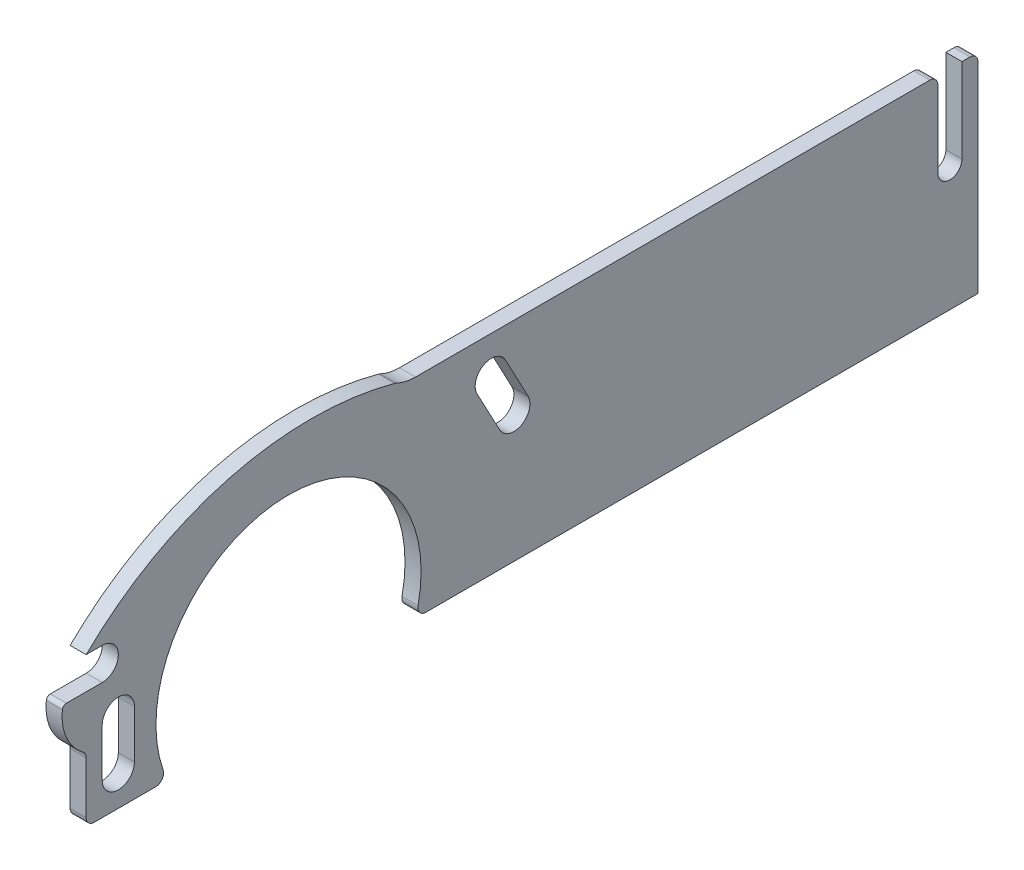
ISO-10303-21;
HEADER;
FILE_DESCRIPTION(('STEP AP214'),'2;1');
FILE_NAME('part.step','',(''),(''),'','','');
FILE_SCHEMA(('AUTOMOTIVE_DESIGN { 1 0 10303 214 1 1 1 1 }'));
ENDSEC;
DATA;
#1=APPLICATION_CONTEXT('core data for automotive mechanical design processes');
#2=APPLICATION_PROTOCOL_DEFINITION('international standard','automotive_design',2000,#1);
#3=PRODUCT_CONTEXT('',#1,'mechanical');
#4=PRODUCT('Part','Part','',(#3));
#5=PRODUCT_RELATED_PRODUCT_CATEGORY('part','',(#4));
#6=PRODUCT_DEFINITION_FORMATION('','',#4);
#7=PRODUCT_DEFINITION_CONTEXT('part definition',#1,'design');
#8=PRODUCT_DEFINITION('design','',#6,#7);
#9=PRODUCT_DEFINITION_SHAPE('','',#8);
#10=(LENGTH_UNIT() NAMED_UNIT(*) SI_UNIT(.MILLI.,.METRE.));
#11=(NAMED_UNIT(*) PLANE_ANGLE_UNIT() SI_UNIT($,.RADIAN.));
#12=(NAMED_UNIT(*) SI_UNIT($,.STERADIAN.) SOLID_ANGLE_UNIT());
#13=UNCERTAINTY_MEASURE_WITH_UNIT(LENGTH_MEASURE(1.E-05),#10,'distance_accuracy_value','');
#14=(GEOMETRIC_REPRESENTATION_CONTEXT(3) GLOBAL_UNCERTAINTY_ASSIGNED_CONTEXT((#13)) GLOBAL_UNIT_ASSIGNED_CONTEXT((#10,
#11,#12)) REPRESENTATION_CONTEXT('',''));
#15=CARTESIAN_POINT('',(0.,0.,0.));
#16=DIRECTION('',(0.,0.,1.));
#17=DIRECTION('',(1.,0.,0.));
#18=AXIS2_PLACEMENT_3D('',#15,#16,#17);
#19=CARTESIAN_POINT('',(2.,0.999999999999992,68.7115878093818));
#20=DIRECTION('',(-1.,0.,0.));
#21=DIRECTION('',(0.,0.,1.));
#22=AXIS2_PLACEMENT_3D('',#19,#20,#21);
#23=PLANE('',#22);
#24=CARTESIAN_POINT('',(2.,7.99999999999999,107.));
#25=DIRECTION('',(1.,0.,0.));
#26=DIRECTION('',(0.,0.,-1.));
#27=AXIS2_PLACEMENT_3D('',#24,#25,#26);
#28=CIRCLE('',#27,2.);
#29=CARTESIAN_POINT('',(2.,7.99999999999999,105.));
#30=VERTEX_POINT('',#29);
#31=CARTESIAN_POINT('',(2.,7.99999999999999,109.));
#32=VERTEX_POINT('',#31);
#33=EDGE_CURVE('E277',#30,#32,#28,.T.);
#34=ORIENTED_EDGE('',*,*,#33,.F.);
#35=DIRECTION('',(0.,1.,0.));
#36=VECTOR('',#35,1.);
#37=CARTESIAN_POINT('',(2.,7.99999999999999,105.));
#38=LINE('',#37,#36);
#39=CARTESIAN_POINT('',(2.,1.99999999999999,105.));
#40=VERTEX_POINT('',#39);
#41=EDGE_CURVE('E285',#40,#30,#38,.T.);
#42=ORIENTED_EDGE('',*,*,#41,.F.);
#43=CARTESIAN_POINT('',(2.,1.99999999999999,107.));
#44=DIRECTION('',(1.,0.,0.));
#45=DIRECTION('',(0.,0.,-1.));
#46=AXIS2_PLACEMENT_3D('',#43,#44,#45);
#47=CIRCLE('',#46,2.);
#48=CARTESIAN_POINT('',(2.,1.99999999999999,109.));
#49=VERTEX_POINT('',#48);
#50=EDGE_CURVE('E282',#49,#40,#47,.T.);
#51=ORIENTED_EDGE('',*,*,#50,.F.);
#52=DIRECTION('',(0.,-1.,0.));
#53=VECTOR('',#52,1.);
#54=CARTESIAN_POINT('',(2.,7.99999999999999,109.));
#55=LINE('',#54,#53);
#56=EDGE_CURVE('E279',#32,#49,#55,.T.);
#57=ORIENTED_EDGE('',*,*,#56,.F.);
#58=EDGE_LOOP('',(#34,#42,#51,#57));
#59=FACE_BOUND('',#58,.T.);
#60=DIRECTION('',(0.,0.,-1.));
#61=VECTOR('',#60,1.);
#62=CARTESIAN_POINT('',(2.,0.,0.));
#63=LINE('',#62,#61);
#64=CARTESIAN_POINT('',(2.,0.,68.7115878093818));
#65=VERTEX_POINT('',#64);
#66=CARTESIAN_POINT('',(2.,0.,0.));
#67=VERTEX_POINT('',#66);
#68=EDGE_CURVE('E308',#65,#67,#63,.T.);
#69=ORIENTED_EDGE('',*,*,#68,.T.);
#70=DIRECTION('',(0.,1.,0.));
#71=VECTOR('',#70,1.);
#72=CARTESIAN_POINT('',(2.,0.,0.));
#73=LINE('',#72,#71);
#74=CARTESIAN_POINT('',(2.,25.,0.));
#75=VERTEX_POINT('',#74);
#76=EDGE_CURVE('E311',#67,#75,#73,.T.);
#77=ORIENTED_EDGE('',*,*,#76,.T.);
#78=CARTESIAN_POINT('',(2.,25.,1.));
#79=DIRECTION('',(1.,0.,0.));
#80=DIRECTION('',(0.,0.,-1.));
#81=AXIS2_PLACEMENT_3D('',#78,#79,#80);
#82=CIRCLE('',#81,1.);
#83=CARTESIAN_POINT('',(2.,26.,1.00000000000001));
#84=VERTEX_POINT('',#83);
#85=EDGE_CURVE('E314',#75,#84,#82,.T.);
#86=ORIENTED_EDGE('',*,*,#85,.T.);
#87=DIRECTION('',(0.,0.,1.));
#88=VECTOR('',#87,1.);
#89=CARTESIAN_POINT('',(2.,26.,1.00000000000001));
#90=LINE('',#89,#88);
#91=CARTESIAN_POINT('',(2.,26.,2.));
#92=VERTEX_POINT('',#91);
#93=EDGE_CURVE('E316',#84,#92,#90,.T.);
#94=ORIENTED_EDGE('',*,*,#93,.T.);
#95=DIRECTION('',(0.,-1.,0.));
#96=VECTOR('',#95,1.);
#97=CARTESIAN_POINT('',(2.,26.,2.));
#98=LINE('',#97,#96);
#99=CARTESIAN_POINT('',(2.,15.5,2.));
#100=VERTEX_POINT('',#99);
#101=EDGE_CURVE('E318',#92,#100,#98,.T.);
#102=ORIENTED_EDGE('',*,*,#101,.T.);
#103=CARTESIAN_POINT('',(2.,15.5,3.5));
#104=DIRECTION('',(-1.,0.,0.));
#105=DIRECTION('',(0.,0.,-1.));
#106=AXIS2_PLACEMENT_3D('',#103,#104,#105);
#107=CIRCLE('',#106,1.5);
#108=CARTESIAN_POINT('',(2.,15.5,5.));
#109=VERTEX_POINT('',#108);
#110=EDGE_CURVE('E320',#100,#109,#107,.T.);
#111=ORIENTED_EDGE('',*,*,#110,.T.);
#112=DIRECTION('',(0.,1.,0.));
#113=VECTOR('',#112,1.);
#114=CARTESIAN_POINT('',(2.,25.,5.));
#115=LINE('',#114,#113);
#116=CARTESIAN_POINT('',(2.,25.,5.));
#117=VERTEX_POINT('',#116);
#118=EDGE_CURVE('E322',#109,#117,#115,.T.);
#119=ORIENTED_EDGE('',*,*,#118,.T.);
#120=CARTESIAN_POINT('',(2.,25.,6.));
#121=DIRECTION('',(1.,0.,0.));
#122=DIRECTION('',(0.,0.,-1.));
#123=AXIS2_PLACEMENT_3D('',#120,#121,#122);
#124=CIRCLE('',#123,1.);
#125=CARTESIAN_POINT('',(2.,26.,6.));
#126=VERTEX_POINT('',#125);
#127=EDGE_CURVE('E324',#117,#126,#124,.T.);
#128=ORIENTED_EDGE('',*,*,#127,.T.);
#129=DIRECTION('',(0.,0.,1.));
#130=VECTOR('',#129,1.);
#131=CARTESIAN_POINT('',(2.,26.,6.));
#132=LINE('',#131,#130);
#133=CARTESIAN_POINT('',(2.,26.,70.));
#134=VERTEX_POINT('',#133);
#135=EDGE_CURVE('E326',#126,#134,#132,.T.);
#136=ORIENTED_EDGE('',*,*,#135,.T.);
#137=CARTESIAN_POINT('',(2.,31.5939226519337,70.));
#138=DIRECTION('',(-1.,0.,0.));
#139=DIRECTION('',(0.,0.,1.));
#140=AXIS2_PLACEMENT_3D('',#137,#138,#139);
#141=CIRCLE('',#140,5.59392265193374);
#142=CARTESIAN_POINT('',(2.,26.5573087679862,72.4340277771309));
#143=VERTEX_POINT('',#142);
#144=EDGE_CURVE('E328',#134,#143,#141,.T.);
#145=ORIENTED_EDGE('',*,*,#144,.T.);
#146=CARTESIAN_POINT('',(2.,25.6569363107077,72.8691478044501));
#147=DIRECTION('',(1.,0.,0.));
#148=DIRECTION('',(0.,0.,-1.));
#149=AXIS2_PLACEMENT_3D('',#146,#147,#148);
#150=CIRCLE('',#149,1.);
#151=CARTESIAN_POINT('',(2.,26.6224823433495,72.6089154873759));
#152=VERTEX_POINT('',#151);
#153=EDGE_CURVE('E330',#143,#152,#150,.T.);
#154=ORIENTED_EDGE('',*,*,#153,.T.);
#155=CARTESIAN_POINT('',(2.,-11.9813943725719,83.0133663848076));
#156=DIRECTION('',(1.,0.,0.));
#157=DIRECTION('',(0.,0.,-1.));
#158=AXIS2_PLACEMENT_3D('',#155,#156,#157);
#159=CIRCLE('',#158,39.9813943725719);
#160=CARTESIAN_POINT('',(2.,16.5713679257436,111.));
#161=VERTEX_POINT('',#160);
#162=EDGE_CURVE('E332',#152,#161,#159,.T.);
#163=ORIENTED_EDGE('',*,*,#162,.T.);
#164=DIRECTION('',(0.,0.,-1.));
#165=VECTOR('',#164,1.);
#166=CARTESIAN_POINT('',(2.,16.5713679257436,111.));
#167=LINE('',#166,#165);
#168=CARTESIAN_POINT('',(2.,16.5713679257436,109.));
#169=VERTEX_POINT('',#168);
#170=EDGE_CURVE('E334',#161,#169,#167,.T.);
#171=ORIENTED_EDGE('',*,*,#170,.T.);
#172=CARTESIAN_POINT('',(2.,14.5713679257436,109.));
#173=DIRECTION('',(-1.,0.,0.));
#174=DIRECTION('',(0.,0.,-1.));
#175=AXIS2_PLACEMENT_3D('',#172,#173,#174);
#176=CIRCLE('',#175,2.);
#177=CARTESIAN_POINT('',(2.,12.5713679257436,109.));
#178=VERTEX_POINT('',#177);
#179=EDGE_CURVE('E336',#169,#178,#176,.T.);
#180=ORIENTED_EDGE('',*,*,#179,.T.);
#181=DIRECTION('',(0.,0.,1.));
#182=VECTOR('',#181,1.);
#183=CARTESIAN_POINT('',(2.,12.5713679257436,113.466213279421));
#184=LINE('',#183,#182);
#185=CARTESIAN_POINT('',(2.,12.5713679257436,113.466213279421));
#186=VERTEX_POINT('',#185);
#187=EDGE_CURVE('E338',#178,#186,#184,.T.);
#188=ORIENTED_EDGE('',*,*,#187,.T.);
#189=CARTESIAN_POINT('',(2.,12.0713679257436,113.466213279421));
#190=DIRECTION('',(1.,0.,0.));
#191=DIRECTION('',(0.,0.,1.));
#192=AXIS2_PLACEMENT_3D('',#189,#190,#191);
#193=CIRCLE('',#192,0.500000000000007);
#194=CARTESIAN_POINT('',(2.,12.1246622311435,113.963364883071));
#195=VERTEX_POINT('',#194);
#196=EDGE_CURVE('E340',#186,#195,#193,.T.);
#197=ORIENTED_EDGE('',*,*,#196,.T.);
#198=CARTESIAN_POINT('',(2.,11.4392087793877,107.569167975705));
#199=DIRECTION('',(1.,0.,0.));
#200=DIRECTION('',(0.,0.,-1.));
#201=AXIS2_PLACEMENT_3D('',#198,#199,#200);
#202=CIRCLE('',#201,6.43083202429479);
#203=CARTESIAN_POINT('',(2.,6.276671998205,111.403723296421));
#204=VERTEX_POINT('',#203);
#205=EDGE_CURVE('E342',#195,#204,#202,.T.);
#206=ORIENTED_EDGE('',*,*,#205,.T.);
#207=CARTESIAN_POINT('',(2.,5.47389301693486,112.));
#208=DIRECTION('',(-1.,0.,0.));
#209=DIRECTION('',(0.,0.,1.));
#210=AXIS2_PLACEMENT_3D('',#207,#208,#209);
#211=CIRCLE('',#210,0.999999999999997);
#212=CARTESIAN_POINT('',(2.,5.47389301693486,111.));
#213=VERTEX_POINT('',#212);
#214=EDGE_CURVE('E344',#204,#213,#211,.T.);
#215=ORIENTED_EDGE('',*,*,#214,.T.);
#216=DIRECTION('',(0.,-1.,0.));
#217=VECTOR('',#216,1.);
#218=CARTESIAN_POINT('',(2.,5.47389301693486,111.));
#219=LINE('',#218,#217);
#220=CARTESIAN_POINT('',(2.,-1.00000000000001,111.));
#221=VERTEX_POINT('',#220);
#222=EDGE_CURVE('E346',#213,#221,#219,.T.);
#223=ORIENTED_EDGE('',*,*,#222,.T.);
#224=CARTESIAN_POINT('',(2.,-1.00000000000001,110.));
#225=DIRECTION('',(1.,0.,0.));
#226=DIRECTION('',(0.,0.,-1.));
#227=AXIS2_PLACEMENT_3D('',#224,#225,#226);
#228=CIRCLE('',#227,1.);
#229=CARTESIAN_POINT('',(2.,-2.00000000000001,110.));
#230=VERTEX_POINT('',#229);
#231=EDGE_CURVE('E348',#221,#230,#228,.T.);
#232=ORIENTED_EDGE('',*,*,#231,.T.);
#233=DIRECTION('',(0.,0.,-1.));
#234=VECTOR('',#233,1.);
#235=CARTESIAN_POINT('',(2.,-2.00000000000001,110.));
#236=LINE('',#235,#234);
#237=CARTESIAN_POINT('',(2.,-2.00000000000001,102.358378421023));
#238=VERTEX_POINT('',#237);
#239=EDGE_CURVE('E350',#230,#238,#236,.T.);
#240=ORIENTED_EDGE('',*,*,#239,.T.);
#241=CARTESIAN_POINT('',(2.,-1.00000000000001,102.358378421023));
#242=DIRECTION('',(1.,0.,0.));
#243=DIRECTION('',(0.,0.,-1.));
#244=AXIS2_PLACEMENT_3D('',#241,#242,#243);
#245=CIRCLE('',#244,1.00000000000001);
#246=CARTESIAN_POINT('',(2.,-0.673950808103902,101.413025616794));
#247=VERTEX_POINT('',#246);
#248=EDGE_CURVE('E352',#238,#247,#245,.T.);
#249=ORIENTED_EDGE('',*,*,#248,.T.);
#250=CARTESIAN_POINT('',(2.,4.70586085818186,85.814704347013));
#251=DIRECTION('',(-1.,0.,0.));
#252=DIRECTION('',(0.,0.,-1.));
#253=AXIS2_PLACEMENT_3D('',#250,#251,#252);
#254=CIRCLE('',#253,16.5);
#255=CARTESIAN_POINT('',(2.,1.21176347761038,69.6889087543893));
#256=VERTEX_POINT('',#255);
#257=EDGE_CURVE('E354',#247,#256,#254,.T.);
#258=ORIENTED_EDGE('',*,*,#257,.T.);
#259=CARTESIAN_POINT('',(2.,0.999999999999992,68.7115878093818));
#260=DIRECTION('',(1.,0.,0.));
#261=DIRECTION('',(0.,0.,1.));
#262=AXIS2_PLACEMENT_3D('',#259,#260,#261);
#263=CIRCLE('',#262,0.99999999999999);
#264=EDGE_CURVE('E356',#256,#65,#263,.T.);
#265=ORIENTED_EDGE('',*,*,#264,.T.);
#266=EDGE_LOOP('',(#69,#77,#86,#94,#102,#111,#119,#128,#136,#145,#154,#163,#171,#180,#188,#197,
#206,#215,#223,#232,#240,#249,#258,#265));
#267=FACE_BOUND('',#266,.T.);
#268=CARTESIAN_POINT('',(2.,21.2976855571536,60.5827245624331));
#269=DIRECTION('',(1.,0.,0.));
#270=DIRECTION('',(0.,0.,-1.));
#271=AXIS2_PLACEMENT_3D('',#268,#269,#270);
#272=CIRCLE('',#271,2.);
#273=CARTESIAN_POINT('',(2.,22.2366286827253,58.8168293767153));
#274=VERTEX_POINT('',#273);
#275=CARTESIAN_POINT('',(2.,20.3587424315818,62.348619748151));
#276=VERTEX_POINT('',#275);
#277=EDGE_CURVE('E241',#274,#276,#272,.T.);
#278=ORIENTED_EDGE('',*,*,#277,.F.);
#279=DIRECTION('',(0.,0.882947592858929,0.469471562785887));
#280=VECTOR('',#279,1.);
#281=CARTESIAN_POINT('',(2.,22.2366286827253,58.8168293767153));
#282=LINE('',#281,#280);
#283=CARTESIAN_POINT('',(2.,16.9389431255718,56.));
#284=VERTEX_POINT('',#283);
#285=EDGE_CURVE('E263',#284,#274,#282,.T.);
#286=ORIENTED_EDGE('',*,*,#285,.F.);
#287=CARTESIAN_POINT('',(2.,16.,57.7658951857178));
#288=DIRECTION('',(1.,0.,0.));
#289=DIRECTION('',(0.,0.,-1.));
#290=AXIS2_PLACEMENT_3D('',#287,#288,#289);
#291=CIRCLE('',#290,2.00000000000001);
#292=CARTESIAN_POINT('',(2.,15.0610568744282,59.5317903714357));
#293=VERTEX_POINT('',#292);
#294=EDGE_CURVE('E261',#293,#284,#291,.T.);
#295=ORIENTED_EDGE('',*,*,#294,.F.);
#296=DIRECTION('',(0.,-0.882947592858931,-0.469471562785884));
#297=VECTOR('',#296,1.);
#298=CARTESIAN_POINT('',(2.,20.3587424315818,62.348619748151));
#299=LINE('',#298,#297);
#300=EDGE_CURVE('E249',#276,#293,#299,.T.);
#301=ORIENTED_EDGE('',*,*,#300,.F.);
#302=EDGE_LOOP('',(#278,#286,#295,#301));
#303=FACE_BOUND('',#302,.T.);
#304=ADVANCED_FACE('F32',(#59,#267,#303),#23,.F.);
#305=CARTESIAN_POINT('',(0.,0.999999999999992,68.7115878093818));
#306=DIRECTION('',(-1.,0.,0.));
#307=DIRECTION('',(0.,0.,1.));
#308=AXIS2_PLACEMENT_3D('',#305,#306,#307);
#309=PLANE('',#308);
#310=DIRECTION('',(0.,1.,0.));
#311=VECTOR('',#310,1.);
#312=CARTESIAN_POINT('',(0.,7.99999999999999,105.));
#313=LINE('',#312,#311);
#314=CARTESIAN_POINT('',(0.,1.99999999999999,105.));
#315=VERTEX_POINT('',#314);
#316=CARTESIAN_POINT('',(0.,7.99999999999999,105.));
#317=VERTEX_POINT('',#316);
#318=EDGE_CURVE('E280',#315,#317,#313,.T.);
#319=ORIENTED_EDGE('',*,*,#318,.T.);
#320=CARTESIAN_POINT('',(0.,7.99999999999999,107.));
#321=DIRECTION('',(1.,0.,0.));
#322=DIRECTION('',(0.,0.,-1.));
#323=AXIS2_PLACEMENT_3D('',#320,#321,#322);
#324=CIRCLE('',#323,2.);
#325=CARTESIAN_POINT('',(0.,7.99999999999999,109.));
#326=VERTEX_POINT('',#325);
#327=EDGE_CURVE('E257',#317,#326,#324,.T.);
#328=ORIENTED_EDGE('',*,*,#327,.T.);
#329=DIRECTION('',(0.,-1.,0.));
#330=VECTOR('',#329,1.);
#331=CARTESIAN_POINT('',(0.,7.99999999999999,109.));
#332=LINE('',#331,#330);
#333=CARTESIAN_POINT('',(0.,1.99999999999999,109.));
#334=VERTEX_POINT('',#333);
#335=EDGE_CURVE('E290',#326,#334,#332,.T.);
#336=ORIENTED_EDGE('',*,*,#335,.T.);
#337=CARTESIAN_POINT('',(0.,1.99999999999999,107.));
#338=DIRECTION('',(1.,0.,0.));
#339=DIRECTION('',(0.,0.,-1.));
#340=AXIS2_PLACEMENT_3D('',#337,#338,#339);
#341=CIRCLE('',#340,2.);
#342=EDGE_CURVE('E293',#334,#315,#341,.T.);
#343=ORIENTED_EDGE('',*,*,#342,.T.);
#344=EDGE_LOOP('',(#319,#328,#336,#343));
#345=FACE_BOUND('',#344,.T.);
#346=DIRECTION('',(0.,0.,-1.));
#347=VECTOR('',#346,1.);
#348=CARTESIAN_POINT('',(0.,0.,0.));
#349=LINE('',#348,#347);
#350=CARTESIAN_POINT('',(0.,0.,68.7115878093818));
#351=VERTEX_POINT('',#350);
#352=CARTESIAN_POINT('',(0.,0.,0.));
#353=VERTEX_POINT('',#352);
#354=EDGE_CURVE('E307',#351,#353,#349,.T.);
#355=ORIENTED_EDGE('',*,*,#354,.F.);
#356=CARTESIAN_POINT('',(0.,0.999999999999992,68.7115878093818));
#357=DIRECTION('',(1.,0.,0.));
#358=DIRECTION('',(0.,0.,1.));
#359=AXIS2_PLACEMENT_3D('',#356,#357,#358);
#360=CIRCLE('',#359,0.99999999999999);
#361=CARTESIAN_POINT('',(0.,1.21176347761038,69.6889087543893));
#362=VERTEX_POINT('',#361);
#363=EDGE_CURVE('E312',#362,#351,#360,.T.);
#364=ORIENTED_EDGE('',*,*,#363,.F.);
#365=CARTESIAN_POINT('',(0.,4.70586085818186,85.814704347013));
#366=DIRECTION('',(-1.,0.,0.));
#367=DIRECTION('',(0.,0.,-1.));
#368=AXIS2_PLACEMENT_3D('',#365,#366,#367);
#369=CIRCLE('',#368,16.5);
#370=CARTESIAN_POINT('',(0.,-0.673950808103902,101.413025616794));
#371=VERTEX_POINT('',#370);
#372=EDGE_CURVE('E403',#371,#362,#369,.T.);
#373=ORIENTED_EDGE('',*,*,#372,.F.);
#374=CARTESIAN_POINT('',(0.,-1.00000000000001,102.358378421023));
#375=DIRECTION('',(1.,0.,0.));
#376=DIRECTION('',(0.,0.,-1.));
#377=AXIS2_PLACEMENT_3D('',#374,#375,#376);
#378=CIRCLE('',#377,1.00000000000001);
#379=CARTESIAN_POINT('',(0.,-2.00000000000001,102.358378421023));
#380=VERTEX_POINT('',#379);
#381=EDGE_CURVE('E401',#380,#371,#378,.T.);
#382=ORIENTED_EDGE('',*,*,#381,.F.);
#383=DIRECTION('',(0.,0.,-1.));
#384=VECTOR('',#383,1.);
#385=CARTESIAN_POINT('',(0.,-2.00000000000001,110.));
#386=LINE('',#385,#384);
#387=CARTESIAN_POINT('',(0.,-2.00000000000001,110.));
#388=VERTEX_POINT('',#387);
#389=EDGE_CURVE('E399',#388,#380,#386,.T.);
#390=ORIENTED_EDGE('',*,*,#389,.F.);
#391=CARTESIAN_POINT('',(0.,-1.00000000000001,110.));
#392=DIRECTION('',(1.,0.,0.));
#393=DIRECTION('',(0.,0.,-1.));
#394=AXIS2_PLACEMENT_3D('',#391,#392,#393);
#395=CIRCLE('',#394,1.);
#396=CARTESIAN_POINT('',(0.,-1.00000000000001,111.));
#397=VERTEX_POINT('',#396);
#398=EDGE_CURVE('E397',#397,#388,#395,.T.);
#399=ORIENTED_EDGE('',*,*,#398,.F.);
#400=DIRECTION('',(0.,-1.,0.));
#401=VECTOR('',#400,1.);
#402=CARTESIAN_POINT('',(0.,5.47389301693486,111.));
#403=LINE('',#402,#401);
#404=CARTESIAN_POINT('',(0.,5.47389301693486,111.));
#405=VERTEX_POINT('',#404);
#406=EDGE_CURVE('E395',#405,#397,#403,.T.);
#407=ORIENTED_EDGE('',*,*,#406,.F.);
#408=CARTESIAN_POINT('',(0.,5.47389301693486,112.));
#409=DIRECTION('',(-1.,0.,0.));
#410=DIRECTION('',(0.,0.,1.));
#411=AXIS2_PLACEMENT_3D('',#408,#409,#410);
#412=CIRCLE('',#411,0.999999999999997);
#413=CARTESIAN_POINT('',(0.,6.276671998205,111.403723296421));
#414=VERTEX_POINT('',#413);
#415=EDGE_CURVE('E393',#414,#405,#412,.T.);
#416=ORIENTED_EDGE('',*,*,#415,.F.);
#417=CARTESIAN_POINT('',(0.,11.4392087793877,107.569167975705));
#418=DIRECTION('',(1.,0.,0.));
#419=DIRECTION('',(0.,0.,-1.));
#420=AXIS2_PLACEMENT_3D('',#417,#418,#419);
#421=CIRCLE('',#420,6.43083202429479);
#422=CARTESIAN_POINT('',(0.,12.1246622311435,113.963364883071));
#423=VERTEX_POINT('',#422);
#424=EDGE_CURVE('E391',#423,#414,#421,.T.);
#425=ORIENTED_EDGE('',*,*,#424,.F.);
#426=CARTESIAN_POINT('',(0.,12.0713679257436,113.466213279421));
#427=DIRECTION('',(1.,0.,0.));
#428=DIRECTION('',(0.,0.,1.));
#429=AXIS2_PLACEMENT_3D('',#426,#427,#428);
#430=CIRCLE('',#429,0.500000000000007);
#431=CARTESIAN_POINT('',(0.,12.5713679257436,113.466213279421));
#432=VERTEX_POINT('',#431);
#433=EDGE_CURVE('E389',#432,#423,#430,.T.);
#434=ORIENTED_EDGE('',*,*,#433,.F.);
#435=DIRECTION('',(0.,0.,1.));
#436=VECTOR('',#435,1.);
#437=CARTESIAN_POINT('',(0.,12.5713679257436,113.466213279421));
#438=LINE('',#437,#436);
#439=CARTESIAN_POINT('',(0.,12.5713679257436,109.));
#440=VERTEX_POINT('',#439);
#441=EDGE_CURVE('E387',#440,#432,#438,.T.);
#442=ORIENTED_EDGE('',*,*,#441,.F.);
#443=CARTESIAN_POINT('',(0.,14.5713679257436,109.));
#444=DIRECTION('',(-1.,0.,0.));
#445=DIRECTION('',(0.,0.,-1.));
#446=AXIS2_PLACEMENT_3D('',#443,#444,#445);
#447=CIRCLE('',#446,2.);
#448=CARTESIAN_POINT('',(0.,16.5713679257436,109.));
#449=VERTEX_POINT('',#448);
#450=EDGE_CURVE('E385',#449,#440,#447,.T.);
#451=ORIENTED_EDGE('',*,*,#450,.F.);
#452=DIRECTION('',(0.,0.,-1.));
#453=VECTOR('',#452,1.);
#454=CARTESIAN_POINT('',(0.,16.5713679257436,111.));
#455=LINE('',#454,#453);
#456=CARTESIAN_POINT('',(0.,16.5713679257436,111.));
#457=VERTEX_POINT('',#456);
#458=EDGE_CURVE('E383',#457,#449,#455,.T.);
#459=ORIENTED_EDGE('',*,*,#458,.F.);
#460=CARTESIAN_POINT('',(0.,-11.9813943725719,83.0133663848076));
#461=DIRECTION('',(1.,0.,0.));
#462=DIRECTION('',(0.,0.,-1.));
#463=AXIS2_PLACEMENT_3D('',#460,#461,#462);
#464=CIRCLE('',#463,39.9813943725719);
#465=CARTESIAN_POINT('',(0.,26.6224823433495,72.6089154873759));
#466=VERTEX_POINT('',#465);
#467=EDGE_CURVE('E381',#466,#457,#464,.T.);
#468=ORIENTED_EDGE('',*,*,#467,.F.);
#469=CARTESIAN_POINT('',(0.,25.6569363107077,72.8691478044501));
#470=DIRECTION('',(1.,0.,0.));
#471=DIRECTION('',(0.,0.,-1.));
#472=AXIS2_PLACEMENT_3D('',#469,#470,#471);
#473=CIRCLE('',#472,1.);
#474=CARTESIAN_POINT('',(0.,26.5573087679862,72.4340277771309));
#475=VERTEX_POINT('',#474);
#476=EDGE_CURVE('E379',#475,#466,#473,.T.);
#477=ORIENTED_EDGE('',*,*,#476,.F.);
#478=CARTESIAN_POINT('',(0.,31.5939226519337,70.));
#479=DIRECTION('',(-1.,0.,0.));
#480=DIRECTION('',(0.,0.,1.));
#481=AXIS2_PLACEMENT_3D('',#478,#479,#480);
#482=CIRCLE('',#481,5.59392265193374);
#483=CARTESIAN_POINT('',(0.,26.,70.));
#484=VERTEX_POINT('',#483);
#485=EDGE_CURVE('E377',#484,#475,#482,.T.);
#486=ORIENTED_EDGE('',*,*,#485,.F.);
#487=DIRECTION('',(0.,0.,1.));
#488=VECTOR('',#487,1.);
#489=CARTESIAN_POINT('',(0.,26.,6.));
#490=LINE('',#489,#488);
#491=CARTESIAN_POINT('',(0.,26.,6.));
#492=VERTEX_POINT('',#491);
#493=EDGE_CURVE('E375',#492,#484,#490,.T.);
#494=ORIENTED_EDGE('',*,*,#493,.F.);
#495=CARTESIAN_POINT('',(0.,25.,6.));
#496=DIRECTION('',(1.,0.,0.));
#497=DIRECTION('',(0.,0.,-1.));
#498=AXIS2_PLACEMENT_3D('',#495,#496,#497);
#499=CIRCLE('',#498,1.);
#500=CARTESIAN_POINT('',(0.,25.,5.));
#501=VERTEX_POINT('',#500);
#502=EDGE_CURVE('E373',#501,#492,#499,.T.);
#503=ORIENTED_EDGE('',*,*,#502,.F.);
#504=DIRECTION('',(0.,1.,0.));
#505=VECTOR('',#504,1.);
#506=CARTESIAN_POINT('',(0.,25.,5.));
#507=LINE('',#506,#505);
#508=CARTESIAN_POINT('',(0.,15.5,5.));
#509=VERTEX_POINT('',#508);
#510=EDGE_CURVE('E371',#509,#501,#507,.T.);
#511=ORIENTED_EDGE('',*,*,#510,.F.);
#512=CARTESIAN_POINT('',(0.,15.5,3.5));
#513=DIRECTION('',(-1.,0.,0.));
#514=DIRECTION('',(0.,0.,-1.));
#515=AXIS2_PLACEMENT_3D('',#512,#513,#514);
#516=CIRCLE('',#515,1.5);
#517=CARTESIAN_POINT('',(0.,15.5,2.));
#518=VERTEX_POINT('',#517);
#519=EDGE_CURVE('E369',#518,#509,#516,.T.);
#520=ORIENTED_EDGE('',*,*,#519,.F.);
#521=DIRECTION('',(0.,-1.,0.));
#522=VECTOR('',#521,1.);
#523=CARTESIAN_POINT('',(0.,26.,2.));
#524=LINE('',#523,#522);
#525=CARTESIAN_POINT('',(0.,26.,2.));
#526=VERTEX_POINT('',#525);
#527=EDGE_CURVE('E367',#526,#518,#524,.T.);
#528=ORIENTED_EDGE('',*,*,#527,.F.);
#529=DIRECTION('',(0.,0.,1.));
#530=VECTOR('',#529,1.);
#531=CARTESIAN_POINT('',(0.,26.,1.00000000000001));
#532=LINE('',#531,#530);
#533=CARTESIAN_POINT('',(0.,26.,1.00000000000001));
#534=VERTEX_POINT('',#533);
#535=EDGE_CURVE('E365',#534,#526,#532,.T.);
#536=ORIENTED_EDGE('',*,*,#535,.F.);
#537=CARTESIAN_POINT('',(0.,25.,1.));
#538=DIRECTION('',(1.,0.,0.));
#539=DIRECTION('',(0.,0.,-1.));
#540=AXIS2_PLACEMENT_3D('',#537,#538,#539);
#541=CIRCLE('',#540,1.);
#542=CARTESIAN_POINT('',(0.,25.,0.));
#543=VERTEX_POINT('',#542);
#544=EDGE_CURVE('E363',#543,#534,#541,.T.);
#545=ORIENTED_EDGE('',*,*,#544,.F.);
#546=DIRECTION('',(0.,1.,0.));
#547=VECTOR('',#546,1.);
#548=CARTESIAN_POINT('',(0.,0.,0.));
#549=LINE('',#548,#547);
#550=EDGE_CURVE('E361',#353,#543,#549,.T.);
#551=ORIENTED_EDGE('',*,*,#550,.F.);
#552=EDGE_LOOP('',(#355,#364,#373,#382,#390,#399,#407,#416,#425,#434,#442,#451,#459,#468,#477,
#486,#494,#503,#511,#520,#528,#536,#545,#551));
#553=FACE_BOUND('',#552,.T.);
#554=DIRECTION('',(0.,0.882947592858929,0.469471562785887));
#555=VECTOR('',#554,1.);
#556=CARTESIAN_POINT('',(0.,22.2366286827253,58.8168293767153));
#557=LINE('',#556,#555);
#558=CARTESIAN_POINT('',(0.,16.9389431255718,56.));
#559=VERTEX_POINT('',#558);
#560=CARTESIAN_POINT('',(0.,22.2366286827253,58.8168293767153));
#561=VERTEX_POINT('',#560);
#562=EDGE_CURVE('E250',#559,#561,#557,.T.);
#563=ORIENTED_EDGE('',*,*,#562,.T.);
#564=CARTESIAN_POINT('',(0.,21.2976855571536,60.5827245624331));
#565=DIRECTION('',(1.,0.,0.));
#566=DIRECTION('',(0.,0.,-1.));
#567=AXIS2_PLACEMENT_3D('',#564,#565,#566);
#568=CIRCLE('',#567,2.);
#569=CARTESIAN_POINT('',(0.,20.3587424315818,62.348619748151));
#570=VERTEX_POINT('',#569);
#571=EDGE_CURVE('E55',#561,#570,#568,.T.);
#572=ORIENTED_EDGE('',*,*,#571,.T.);
#573=DIRECTION('',(0.,-0.882947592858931,-0.469471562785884));
#574=VECTOR('',#573,1.);
#575=CARTESIAN_POINT('',(0.,20.3587424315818,62.348619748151));
#576=LINE('',#575,#574);
#577=CARTESIAN_POINT('',(0.,15.0610568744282,59.5317903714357));
#578=VERTEX_POINT('',#577);
#579=EDGE_CURVE('E256',#570,#578,#576,.T.);
#580=ORIENTED_EDGE('',*,*,#579,.T.);
#581=CARTESIAN_POINT('',(0.,16.,57.7658951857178));
#582=DIRECTION('',(1.,0.,0.));
#583=DIRECTION('',(0.,0.,-1.));
#584=AXIS2_PLACEMENT_3D('',#581,#582,#583);
#585=CIRCLE('',#584,2.00000000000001);
#586=EDGE_CURVE('E269',#578,#559,#585,.T.);
#587=ORIENTED_EDGE('',*,*,#586,.T.);
#588=EDGE_LOOP('',(#563,#572,#580,#587));
#589=FACE_BOUND('',#588,.T.);
#590=ADVANCED_FACE('F481',(#345,#553,#589),#309,.T.);
#591=CARTESIAN_POINT('',(2.,0.,0.));
#592=DIRECTION('',(0.,1.,0.));
#593=DIRECTION('',(0.,0.,1.));
#594=AXIS2_PLACEMENT_3D('',#591,#592,#593);
#595=PLANE('',#594);
#596=ORIENTED_EDGE('',*,*,#354,.T.);
#597=DIRECTION('',(-1.,0.,0.));
#598=VECTOR('',#597,1.);
#599=CARTESIAN_POINT('',(2.,0.,0.));
#600=LINE('',#599,#598);
#601=EDGE_CURVE('E11',#67,#353,#600,.T.);
#602=ORIENTED_EDGE('',*,*,#601,.F.);
#603=ORIENTED_EDGE('',*,*,#68,.F.);
#604=DIRECTION('',(-1.,0.,0.));
#605=VECTOR('',#604,1.);
#606=CARTESIAN_POINT('',(2.,0.,68.7115878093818));
#607=LINE('',#606,#605);
#608=EDGE_CURVE('E358',#65,#351,#607,.T.);
#609=ORIENTED_EDGE('',*,*,#608,.T.);
#610=EDGE_LOOP('',(#596,#602,#603,#609));
#611=FACE_BOUND('',#610,.T.);
#612=ADVANCED_FACE('F34',(#611),#595,.F.);
#613=CARTESIAN_POINT('',(2.,0.,0.));
#614=DIRECTION('',(0.,0.,1.));
#615=DIRECTION('',(1.,0.,0.));
#616=AXIS2_PLACEMENT_3D('',#613,#614,#615);
#617=PLANE('',#616);
#618=ORIENTED_EDGE('',*,*,#550,.T.);
#619=DIRECTION('',(-1.,0.,0.));
#620=VECTOR('',#619,1.);
#621=CARTESIAN_POINT('',(2.,25.,0.));
#622=LINE('',#621,#620);
#623=EDGE_CURVE('E40',#75,#543,#622,.T.);
#624=ORIENTED_EDGE('',*,*,#623,.F.);
#625=ORIENTED_EDGE('',*,*,#76,.F.);
#626=ORIENTED_EDGE('',*,*,#601,.T.);
#627=EDGE_LOOP('',(#618,#624,#625,#626));
#628=FACE_BOUND('',#627,.T.);
#629=ADVANCED_FACE('F498',(#628),#617,.F.);
#630=CARTESIAN_POINT('',(2.,25.,1.));
#631=DIRECTION('',(-1.,0.,0.));
#632=DIRECTION('',(0.,0.,1.));
#633=AXIS2_PLACEMENT_3D('',#630,#631,#632);
#634=CYLINDRICAL_SURFACE('',#633,1.);
#635=ORIENTED_EDGE('',*,*,#544,.T.);
#636=DIRECTION('',(-1.,0.,0.));
#637=VECTOR('',#636,1.);
#638=CARTESIAN_POINT('',(2.,26.,1.00000000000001));
#639=LINE('',#638,#637);
#640=EDGE_CURVE('E468',#84,#534,#639,.T.);
#641=ORIENTED_EDGE('',*,*,#640,.F.);
#642=ORIENTED_EDGE('',*,*,#85,.F.);
#643=ORIENTED_EDGE('',*,*,#623,.T.);
#644=EDGE_LOOP('',(#635,#641,#642,#643));
#645=FACE_BOUND('',#644,.T.);
#646=ADVANCED_FACE('F475',(#645),#634,.T.);
#647=CARTESIAN_POINT('',(2.,26.,1.00000000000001));
#648=DIRECTION('',(0.,-1.,0.));
#649=DIRECTION('',(0.,0.,-1.));
#650=AXIS2_PLACEMENT_3D('',#647,#648,#649);
#651=PLANE('',#650);
#652=ORIENTED_EDGE('',*,*,#535,.T.);
#653=DIRECTION('',(-1.,0.,0.));
#654=VECTOR('',#653,1.);
#655=CARTESIAN_POINT('',(2.,26.,2.));
#656=LINE('',#655,#654);
#657=EDGE_CURVE('E465',#92,#526,#656,.T.);
#658=ORIENTED_EDGE('',*,*,#657,.F.);
#659=ORIENTED_EDGE('',*,*,#93,.F.);
#660=ORIENTED_EDGE('',*,*,#640,.T.);
#661=EDGE_LOOP('',(#652,#658,#659,#660));
#662=FACE_BOUND('',#661,.T.);
#663=ADVANCED_FACE('F487',(#662),#651,.F.);
#664=CARTESIAN_POINT('',(2.,26.,2.));
#665=DIRECTION('',(0.,0.,-1.));
#666=DIRECTION('',(0.,1.,0.));
#667=AXIS2_PLACEMENT_3D('',#664,#665,#666);
#668=PLANE('',#667);
#669=ORIENTED_EDGE('',*,*,#527,.T.);
#670=DIRECTION('',(-1.,0.,0.));
#671=VECTOR('',#670,1.);
#672=CARTESIAN_POINT('',(2.,15.5,2.));
#673=LINE('',#672,#671);
#674=EDGE_CURVE('E462',#100,#518,#673,.T.);
#675=ORIENTED_EDGE('',*,*,#674,.F.);
#676=ORIENTED_EDGE('',*,*,#101,.F.);
#677=ORIENTED_EDGE('',*,*,#657,.T.);
#678=EDGE_LOOP('',(#669,#675,#676,#677));
#679=FACE_BOUND('',#678,.T.);
#680=ADVANCED_FACE('F491',(#679),#668,.F.);
#681=CARTESIAN_POINT('',(2.,15.5,3.5));
#682=DIRECTION('',(-1.,0.,0.));
#683=DIRECTION('',(0.,0.,1.));
#684=AXIS2_PLACEMENT_3D('',#681,#682,#683);
#685=CYLINDRICAL_SURFACE('',#684,1.5);
#686=ORIENTED_EDGE('',*,*,#519,.T.);
#687=DIRECTION('',(-1.,0.,0.));
#688=VECTOR('',#687,1.);
#689=CARTESIAN_POINT('',(2.,15.5,5.));
#690=LINE('',#689,#688);
#691=EDGE_CURVE('E459',#109,#509,#690,.T.);
#692=ORIENTED_EDGE('',*,*,#691,.F.);
#693=ORIENTED_EDGE('',*,*,#110,.F.);
#694=ORIENTED_EDGE('',*,*,#674,.T.);
#695=EDGE_LOOP('',(#686,#692,#693,#694));
#696=FACE_BOUND('',#695,.T.);
#697=ADVANCED_FACE('F591',(#696),#685,.F.);
#698=CARTESIAN_POINT('',(2.,25.,5.));
#699=DIRECTION('',(0.,0.,1.));
#700=DIRECTION('',(0.,-1.,0.));
#701=AXIS2_PLACEMENT_3D('',#698,#699,#700);
#702=PLANE('',#701);
#703=ORIENTED_EDGE('',*,*,#510,.T.);
#704=DIRECTION('',(-1.,0.,0.));
#705=VECTOR('',#704,1.);
#706=CARTESIAN_POINT('',(2.,25.,5.));
#707=LINE('',#706,#705);
#708=EDGE_CURVE('E456',#117,#501,#707,.T.);
#709=ORIENTED_EDGE('',*,*,#708,.F.);
#710=ORIENTED_EDGE('',*,*,#118,.F.);
#711=ORIENTED_EDGE('',*,*,#691,.T.);
#712=EDGE_LOOP('',(#703,#709,#710,#711));
#713=FACE_BOUND('',#712,.T.);
#714=ADVANCED_FACE('F589',(#713),#702,.F.);
#715=CARTESIAN_POINT('',(2.,25.,6.));
#716=DIRECTION('',(-1.,0.,0.));
#717=DIRECTION('',(0.,0.,1.));
#718=AXIS2_PLACEMENT_3D('',#715,#716,#717);
#719=CYLINDRICAL_SURFACE('',#718,1.);
#720=ORIENTED_EDGE('',*,*,#502,.T.);
#721=DIRECTION('',(-1.,0.,0.));
#722=VECTOR('',#721,1.);
#723=CARTESIAN_POINT('',(2.,26.,6.));
#724=LINE('',#723,#722);
#725=EDGE_CURVE('E453',#126,#492,#724,.T.);
#726=ORIENTED_EDGE('',*,*,#725,.F.);
#727=ORIENTED_EDGE('',*,*,#127,.F.);
#728=ORIENTED_EDGE('',*,*,#708,.T.);
#729=EDGE_LOOP('',(#720,#726,#727,#728));
#730=FACE_BOUND('',#729,.T.);
#731=ADVANCED_FACE('F585',(#730),#719,.T.);
#732=CARTESIAN_POINT('',(2.,26.,6.));
#733=DIRECTION('',(0.,-1.,0.));
#734=DIRECTION('',(0.,0.,-1.));
#735=AXIS2_PLACEMENT_3D('',#732,#733,#734);
#736=PLANE('',#735);
#737=ORIENTED_EDGE('',*,*,#493,.T.);
#738=DIRECTION('',(-1.,0.,0.));
#739=VECTOR('',#738,1.);
#740=CARTESIAN_POINT('',(2.,26.,70.));
#741=LINE('',#740,#739);
#742=EDGE_CURVE('E450',#134,#484,#741,.T.);
#743=ORIENTED_EDGE('',*,*,#742,.F.);
#744=ORIENTED_EDGE('',*,*,#135,.F.);
#745=ORIENTED_EDGE('',*,*,#725,.T.);
#746=EDGE_LOOP('',(#737,#743,#744,#745));
#747=FACE_BOUND('',#746,.T.);
#748=ADVANCED_FACE('F580',(#747),#736,.F.);
#749=CARTESIAN_POINT('',(2.,31.5939226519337,70.));
#750=DIRECTION('',(-1.,0.,0.));
#751=DIRECTION('',(0.,0.,1.));
#752=AXIS2_PLACEMENT_3D('',#749,#750,#751);
#753=CYLINDRICAL_SURFACE('',#752,5.59392265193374);
#754=ORIENTED_EDGE('',*,*,#485,.T.);
#755=DIRECTION('',(-1.,0.,0.));
#756=VECTOR('',#755,1.);
#757=CARTESIAN_POINT('',(2.,26.5573087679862,72.4340277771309));
#758=LINE('',#757,#756);
#759=EDGE_CURVE('E447',#143,#475,#758,.T.);
#760=ORIENTED_EDGE('',*,*,#759,.F.);
#761=ORIENTED_EDGE('',*,*,#144,.F.);
#762=ORIENTED_EDGE('',*,*,#742,.T.);
#763=EDGE_LOOP('',(#754,#760,#761,#762));
#764=FACE_BOUND('',#763,.T.);
#765=ADVANCED_FACE('F574',(#764),#753,.F.);
#766=CARTESIAN_POINT('',(2.,25.6569363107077,72.8691478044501));
#767=DIRECTION('',(-1.,0.,0.));
#768=DIRECTION('',(0.,0.,1.));
#769=AXIS2_PLACEMENT_3D('',#766,#767,#768);
#770=CYLINDRICAL_SURFACE('',#769,1.);
#771=ORIENTED_EDGE('',*,*,#476,.T.);
#772=DIRECTION('',(-1.,0.,0.));
#773=VECTOR('',#772,1.);
#774=CARTESIAN_POINT('',(2.,26.6224823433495,72.6089154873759));
#775=LINE('',#774,#773);
#776=EDGE_CURVE('E444',#152,#466,#775,.T.);
#777=ORIENTED_EDGE('',*,*,#776,.F.);
#778=ORIENTED_EDGE('',*,*,#153,.F.);
#779=ORIENTED_EDGE('',*,*,#759,.T.);
#780=EDGE_LOOP('',(#771,#777,#778,#779));
#781=FACE_BOUND('',#780,.T.);
#782=ADVANCED_FACE('F570',(#781),#770,.T.);
#783=CARTESIAN_POINT('',(2.,-11.9813943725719,83.0133663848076));
#784=DIRECTION('',(-1.,0.,0.));
#785=DIRECTION('',(0.,0.,1.));
#786=AXIS2_PLACEMENT_3D('',#783,#784,#785);
#787=CYLINDRICAL_SURFACE('',#786,39.9813943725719);
#788=ORIENTED_EDGE('',*,*,#467,.T.);
#789=DIRECTION('',(-1.,0.,0.));
#790=VECTOR('',#789,1.);
#791=CARTESIAN_POINT('',(2.,16.5713679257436,111.));
#792=LINE('',#791,#790);
#793=EDGE_CURVE('E441',#161,#457,#792,.T.);
#794=ORIENTED_EDGE('',*,*,#793,.F.);
#795=ORIENTED_EDGE('',*,*,#162,.F.);
#796=ORIENTED_EDGE('',*,*,#776,.T.);
#797=EDGE_LOOP('',(#788,#794,#795,#796));
#798=FACE_BOUND('',#797,.T.);
#799=ADVANCED_FACE('F565',(#798),#787,.T.);
#800=CARTESIAN_POINT('',(2.,16.5713679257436,111.));
#801=DIRECTION('',(0.,1.,0.));
#802=DIRECTION('',(0.,0.,1.));
#803=AXIS2_PLACEMENT_3D('',#800,#801,#802);
#804=PLANE('',#803);
#805=ORIENTED_EDGE('',*,*,#458,.T.);
#806=DIRECTION('',(-1.,0.,0.));
#807=VECTOR('',#806,1.);
#808=CARTESIAN_POINT('',(2.,16.5713679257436,109.));
#809=LINE('',#808,#807);
#810=EDGE_CURVE('E438',#169,#449,#809,.T.);
#811=ORIENTED_EDGE('',*,*,#810,.F.);
#812=ORIENTED_EDGE('',*,*,#170,.F.);
#813=ORIENTED_EDGE('',*,*,#793,.T.);
#814=EDGE_LOOP('',(#805,#811,#812,#813));
#815=FACE_BOUND('',#814,.T.);
#816=ADVANCED_FACE('F559',(#815),#804,.F.);
#817=CARTESIAN_POINT('',(2.,14.5713679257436,109.));
#818=DIRECTION('',(-1.,0.,0.));
#819=DIRECTION('',(0.,0.,1.));
#820=AXIS2_PLACEMENT_3D('',#817,#818,#819);
#821=CYLINDRICAL_SURFACE('',#820,2.);
#822=ORIENTED_EDGE('',*,*,#450,.T.);
#823=DIRECTION('',(-1.,0.,0.));
#824=VECTOR('',#823,1.);
#825=CARTESIAN_POINT('',(2.,12.5713679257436,109.));
#826=LINE('',#825,#824);
#827=EDGE_CURVE('E435',#178,#440,#826,.T.);
#828=ORIENTED_EDGE('',*,*,#827,.F.);
#829=ORIENTED_EDGE('',*,*,#179,.F.);
#830=ORIENTED_EDGE('',*,*,#810,.T.);
#831=EDGE_LOOP('',(#822,#828,#829,#830));
#832=FACE_BOUND('',#831,.T.);
#833=ADVANCED_FACE('F555',(#832),#821,.F.);
#834=CARTESIAN_POINT('',(2.,12.5713679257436,113.466213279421));
#835=DIRECTION('',(0.,-1.,0.));
#836=DIRECTION('',(0.,0.,-1.));
#837=AXIS2_PLACEMENT_3D('',#834,#835,#836);
#838=PLANE('',#837);
#839=ORIENTED_EDGE('',*,*,#441,.T.);
#840=DIRECTION('',(-1.,0.,0.));
#841=VECTOR('',#840,1.);
#842=CARTESIAN_POINT('',(2.,12.5713679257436,113.466213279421));
#843=LINE('',#842,#841);
#844=EDGE_CURVE('E432',#186,#432,#843,.T.);
#845=ORIENTED_EDGE('',*,*,#844,.F.);
#846=ORIENTED_EDGE('',*,*,#187,.F.);
#847=ORIENTED_EDGE('',*,*,#827,.T.);
#848=EDGE_LOOP('',(#839,#845,#846,#847));
#849=FACE_BOUND('',#848,.T.);
#850=ADVANCED_FACE('F550',(#849),#838,.F.);
#851=CARTESIAN_POINT('',(2.,12.0713679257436,113.466213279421));
#852=DIRECTION('',(-1.,0.,0.));
#853=DIRECTION('',(0.,0.,1.));
#854=AXIS2_PLACEMENT_3D('',#851,#852,#853);
#855=CYLINDRICAL_SURFACE('',#854,0.500000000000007);
#856=ORIENTED_EDGE('',*,*,#433,.T.);
#857=DIRECTION('',(-1.,0.,0.));
#858=VECTOR('',#857,1.);
#859=CARTESIAN_POINT('',(2.,12.1246622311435,113.963364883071));
#860=LINE('',#859,#858);
#861=EDGE_CURVE('E429',#195,#423,#860,.T.);
#862=ORIENTED_EDGE('',*,*,#861,.F.);
#863=ORIENTED_EDGE('',*,*,#196,.F.);
#864=ORIENTED_EDGE('',*,*,#844,.T.);
#865=EDGE_LOOP('',(#856,#862,#863,#864));
#866=FACE_BOUND('',#865,.T.);
#867=ADVANCED_FACE('F544',(#866),#855,.T.);
#868=CARTESIAN_POINT('',(2.,11.4392087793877,107.569167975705));
#869=DIRECTION('',(-1.,0.,0.));
#870=DIRECTION('',(0.,0.,1.));
#871=AXIS2_PLACEMENT_3D('',#868,#869,#870);
#872=CYLINDRICAL_SURFACE('',#871,6.43083202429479);
#873=ORIENTED_EDGE('',*,*,#424,.T.);
#874=DIRECTION('',(-1.,0.,0.));
#875=VECTOR('',#874,1.);
#876=CARTESIAN_POINT('',(2.,6.276671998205,111.403723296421));
#877=LINE('',#876,#875);
#878=EDGE_CURVE('E426',#204,#414,#877,.T.);
#879=ORIENTED_EDGE('',*,*,#878,.F.);
#880=ORIENTED_EDGE('',*,*,#205,.F.);
#881=ORIENTED_EDGE('',*,*,#861,.T.);
#882=EDGE_LOOP('',(#873,#879,#880,#881));
#883=FACE_BOUND('',#882,.T.);
#884=ADVANCED_FACE('F540',(#883),#872,.T.);
#885=CARTESIAN_POINT('',(2.,5.47389301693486,112.));
#886=DIRECTION('',(-1.,0.,0.));
#887=DIRECTION('',(0.,0.,1.));
#888=AXIS2_PLACEMENT_3D('',#885,#886,#887);
#889=CYLINDRICAL_SURFACE('',#888,0.999999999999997);
#890=ORIENTED_EDGE('',*,*,#415,.T.);
#891=DIRECTION('',(-1.,0.,0.));
#892=VECTOR('',#891,1.);
#893=CARTESIAN_POINT('',(2.,5.47389301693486,111.));
#894=LINE('',#893,#892);
#895=EDGE_CURVE('E423',#213,#405,#894,.T.);
#896=ORIENTED_EDGE('',*,*,#895,.F.);
#897=ORIENTED_EDGE('',*,*,#214,.F.);
#898=ORIENTED_EDGE('',*,*,#878,.T.);
#899=EDGE_LOOP('',(#890,#896,#897,#898));
#900=FACE_BOUND('',#899,.T.);
#901=ADVANCED_FACE('F535',(#900),#889,.F.);
#902=CARTESIAN_POINT('',(2.,5.47389301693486,111.));
#903=DIRECTION('',(0.,0.,-1.));
#904=DIRECTION('',(-1.,0.,0.));
#905=AXIS2_PLACEMENT_3D('',#902,#903,#904);
#906=PLANE('',#905);
#907=ORIENTED_EDGE('',*,*,#406,.T.);
#908=DIRECTION('',(-1.,0.,0.));
#909=VECTOR('',#908,1.);
#910=CARTESIAN_POINT('',(2.,-1.00000000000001,111.));
#911=LINE('',#910,#909);
#912=EDGE_CURVE('E420',#221,#397,#911,.T.);
#913=ORIENTED_EDGE('',*,*,#912,.F.);
#914=ORIENTED_EDGE('',*,*,#222,.F.);
#915=ORIENTED_EDGE('',*,*,#895,.T.);
#916=EDGE_LOOP('',(#907,#913,#914,#915));
#917=FACE_BOUND('',#916,.T.);
#918=ADVANCED_FACE('F529',(#917),#906,.F.);
#919=CARTESIAN_POINT('',(2.,-1.00000000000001,110.));
#920=DIRECTION('',(-1.,0.,0.));
#921=DIRECTION('',(0.,0.,1.));
#922=AXIS2_PLACEMENT_3D('',#919,#920,#921);
#923=CYLINDRICAL_SURFACE('',#922,1.);
#924=ORIENTED_EDGE('',*,*,#398,.T.);
#925=DIRECTION('',(-1.,0.,0.));
#926=VECTOR('',#925,1.);
#927=CARTESIAN_POINT('',(2.,-2.00000000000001,110.));
#928=LINE('',#927,#926);
#929=EDGE_CURVE('E417',#230,#388,#928,.T.);
#930=ORIENTED_EDGE('',*,*,#929,.F.);
#931=ORIENTED_EDGE('',*,*,#231,.F.);
#932=ORIENTED_EDGE('',*,*,#912,.T.);
#933=EDGE_LOOP('',(#924,#930,#931,#932));
#934=FACE_BOUND('',#933,.T.);
#935=ADVANCED_FACE('F525',(#934),#923,.T.);
#936=CARTESIAN_POINT('',(2.,-2.00000000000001,110.));
#937=DIRECTION('',(0.,1.,0.));
#938=DIRECTION('',(0.,0.,1.));
#939=AXIS2_PLACEMENT_3D('',#936,#937,#938);
#940=PLANE('',#939);
#941=ORIENTED_EDGE('',*,*,#389,.T.);
#942=DIRECTION('',(-1.,0.,0.));
#943=VECTOR('',#942,1.);
#944=CARTESIAN_POINT('',(2.,-2.00000000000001,102.358378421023));
#945=LINE('',#944,#943);
#946=EDGE_CURVE('E414',#238,#380,#945,.T.);
#947=ORIENTED_EDGE('',*,*,#946,.F.);
#948=ORIENTED_EDGE('',*,*,#239,.F.);
#949=ORIENTED_EDGE('',*,*,#929,.T.);
#950=EDGE_LOOP('',(#941,#947,#948,#949));
#951=FACE_BOUND('',#950,.T.);
#952=ADVANCED_FACE('F520',(#951),#940,.F.);
#953=CARTESIAN_POINT('',(2.,-1.00000000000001,102.358378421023));
#954=DIRECTION('',(-1.,0.,0.));
#955=DIRECTION('',(0.,0.,1.));
#956=AXIS2_PLACEMENT_3D('',#953,#954,#955);
#957=CYLINDRICAL_SURFACE('',#956,1.00000000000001);
#958=ORIENTED_EDGE('',*,*,#381,.T.);
#959=DIRECTION('',(-1.,0.,0.));
#960=VECTOR('',#959,1.);
#961=CARTESIAN_POINT('',(2.,-0.673950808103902,101.413025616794));
#962=LINE('',#961,#960);
#963=EDGE_CURVE('E411',#247,#371,#962,.T.);
#964=ORIENTED_EDGE('',*,*,#963,.F.);
#965=ORIENTED_EDGE('',*,*,#248,.F.);
#966=ORIENTED_EDGE('',*,*,#946,.T.);
#967=EDGE_LOOP('',(#958,#964,#965,#966));
#968=FACE_BOUND('',#967,.T.);
#969=ADVANCED_FACE('F514',(#968),#957,.T.);
#970=CARTESIAN_POINT('',(2.,4.70586085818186,85.814704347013));
#971=DIRECTION('',(-1.,0.,0.));
#972=DIRECTION('',(0.,0.,1.));
#973=AXIS2_PLACEMENT_3D('',#970,#971,#972);
#974=CYLINDRICAL_SURFACE('',#973,16.5);
#975=ORIENTED_EDGE('',*,*,#372,.T.);
#976=DIRECTION('',(-1.,0.,0.));
#977=VECTOR('',#976,1.);
#978=CARTESIAN_POINT('',(2.,1.21176347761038,69.6889087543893));
#979=LINE('',#978,#977);
#980=EDGE_CURVE('E408',#256,#362,#979,.T.);
#981=ORIENTED_EDGE('',*,*,#980,.F.);
#982=ORIENTED_EDGE('',*,*,#257,.F.);
#983=ORIENTED_EDGE('',*,*,#963,.T.);
#984=EDGE_LOOP('',(#975,#981,#982,#983));
#985=FACE_BOUND('',#984,.T.);
#986=ADVANCED_FACE('F510',(#985),#974,.F.);
#987=CARTESIAN_POINT('',(2.,0.999999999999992,68.7115878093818));
#988=DIRECTION('',(-1.,0.,0.));
#989=DIRECTION('',(0.,0.,1.));
#990=AXIS2_PLACEMENT_3D('',#987,#988,#989);
#991=CYLINDRICAL_SURFACE('',#990,0.99999999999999);
#992=ORIENTED_EDGE('',*,*,#363,.T.);
#993=ORIENTED_EDGE('',*,*,#608,.F.);
#994=ORIENTED_EDGE('',*,*,#264,.F.);
#995=ORIENTED_EDGE('',*,*,#980,.T.);
#996=EDGE_LOOP('',(#992,#993,#994,#995));
#997=FACE_BOUND('',#996,.T.);
#998=ADVANCED_FACE('F505',(#997),#991,.T.);
#999=CARTESIAN_POINT('',(2.,7.99999999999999,107.));
#1000=DIRECTION('',(-1.,0.,0.));
#1001=DIRECTION('',(0.,0.,1.));
#1002=AXIS2_PLACEMENT_3D('',#999,#1000,#1001);
#1003=CYLINDRICAL_SURFACE('',#1002,2.);
#1004=ORIENTED_EDGE('',*,*,#327,.F.);
#1005=DIRECTION('',(-1.,0.,0.));
#1006=VECTOR('',#1005,1.);
#1007=CARTESIAN_POINT('',(2.,7.99999999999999,105.));
#1008=LINE('',#1007,#1006);
#1009=EDGE_CURVE('E287',#30,#317,#1008,.T.);
#1010=ORIENTED_EDGE('',*,*,#1009,.F.);
#1011=ORIENTED_EDGE('',*,*,#33,.T.);
#1012=DIRECTION('',(-1.,0.,0.));
#1013=VECTOR('',#1012,1.);
#1014=CARTESIAN_POINT('',(2.,7.99999999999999,109.));
#1015=LINE('',#1014,#1013);
#1016=EDGE_CURVE('E304',#32,#326,#1015,.T.);
#1017=ORIENTED_EDGE('',*,*,#1016,.T.);
#1018=EDGE_LOOP('',(#1004,#1010,#1011,#1017));
#1019=FACE_BOUND('',#1018,.T.);
#1020=ADVANCED_FACE('F610',(#1019),#1003,.F.);
#1021=CARTESIAN_POINT('',(2.,7.99999999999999,109.));
#1022=DIRECTION('',(0.,0.,-1.));
#1023=DIRECTION('',(-1.,0.,0.));
#1024=AXIS2_PLACEMENT_3D('',#1021,#1022,#1023);
#1025=PLANE('',#1024);
#1026=ORIENTED_EDGE('',*,*,#335,.F.);
#1027=ORIENTED_EDGE('',*,*,#1016,.F.);
#1028=ORIENTED_EDGE('',*,*,#56,.T.);
#1029=DIRECTION('',(-1.,0.,0.));
#1030=VECTOR('',#1029,1.);
#1031=CARTESIAN_POINT('',(2.,1.99999999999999,109.));
#1032=LINE('',#1031,#1030);
#1033=EDGE_CURVE('E302',#49,#334,#1032,.T.);
#1034=ORIENTED_EDGE('',*,*,#1033,.T.);
#1035=EDGE_LOOP('',(#1026,#1027,#1028,#1034));
#1036=FACE_BOUND('',#1035,.T.);
#1037=ADVANCED_FACE('F720',(#1036),#1025,.T.);
#1038=CARTESIAN_POINT('',(2.,1.99999999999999,107.));
#1039=DIRECTION('',(-1.,0.,0.));
#1040=DIRECTION('',(0.,0.,1.));
#1041=AXIS2_PLACEMENT_3D('',#1038,#1039,#1040);
#1042=CYLINDRICAL_SURFACE('',#1041,2.);
#1043=ORIENTED_EDGE('',*,*,#342,.F.);
#1044=ORIENTED_EDGE('',*,*,#1033,.F.);
#1045=ORIENTED_EDGE('',*,*,#50,.T.);
#1046=DIRECTION('',(-1.,0.,0.));
#1047=VECTOR('',#1046,1.);
#1048=CARTESIAN_POINT('',(2.,1.99999999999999,105.));
#1049=LINE('',#1048,#1047);
#1050=EDGE_CURVE('E300',#40,#315,#1049,.T.);
#1051=ORIENTED_EDGE('',*,*,#1050,.T.);
#1052=EDGE_LOOP('',(#1043,#1044,#1045,#1051));
#1053=FACE_BOUND('',#1052,.T.);
#1054=ADVANCED_FACE('F727',(#1053),#1042,.F.);
#1055=CARTESIAN_POINT('',(2.,7.99999999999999,105.));
#1056=DIRECTION('',(0.,0.,1.));
#1057=DIRECTION('',(1.,0.,0.));
#1058=AXIS2_PLACEMENT_3D('',#1055,#1056,#1057);
#1059=PLANE('',#1058);
#1060=ORIENTED_EDGE('',*,*,#318,.F.);
#1061=ORIENTED_EDGE('',*,*,#1050,.F.);
#1062=ORIENTED_EDGE('',*,*,#41,.T.);
#1063=ORIENTED_EDGE('',*,*,#1009,.T.);
#1064=EDGE_LOOP('',(#1060,#1061,#1062,#1063));
#1065=FACE_BOUND('',#1064,.T.);
#1066=ADVANCED_FACE('F734',(#1065),#1059,.T.);
#1067=CARTESIAN_POINT('',(2.,21.2976855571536,60.5827245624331));
#1068=DIRECTION('',(-1.,0.,0.));
#1069=DIRECTION('',(0.,0.,1.));
#1070=AXIS2_PLACEMENT_3D('',#1067,#1068,#1069);
#1071=CYLINDRICAL_SURFACE('',#1070,2.);
#1072=ORIENTED_EDGE('',*,*,#571,.F.);
#1073=DIRECTION('',(-1.,0.,0.));
#1074=VECTOR('',#1073,1.);
#1075=CARTESIAN_POINT('',(2.,22.2366286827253,58.8168293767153));
#1076=LINE('',#1075,#1074);
#1077=EDGE_CURVE('E245',#274,#561,#1076,.T.);
#1078=ORIENTED_EDGE('',*,*,#1077,.F.);
#1079=ORIENTED_EDGE('',*,*,#277,.T.);
#1080=DIRECTION('',(-1.,0.,0.));
#1081=VECTOR('',#1080,1.);
#1082=CARTESIAN_POINT('',(2.,20.3587424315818,62.348619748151));
#1083=LINE('',#1082,#1081);
#1084=EDGE_CURVE('E244',#276,#570,#1083,.T.);
#1085=ORIENTED_EDGE('',*,*,#1084,.T.);
#1086=EDGE_LOOP('',(#1072,#1078,#1079,#1085));
#1087=FACE_BOUND('',#1086,.T.);
#1088=ADVANCED_FACE('F243',(#1087),#1071,.F.);
#1089=CARTESIAN_POINT('',(2.,20.3587424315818,62.348619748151));
#1090=DIRECTION('',(0.,0.469471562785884,-0.882947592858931));
#1091=DIRECTION('',(0.,0.882947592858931,0.469471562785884));
#1092=AXIS2_PLACEMENT_3D('',#1089,#1090,#1091);
#1093=PLANE('',#1092);
#1094=ORIENTED_EDGE('',*,*,#579,.F.);
#1095=ORIENTED_EDGE('',*,*,#1084,.F.);
#1096=ORIENTED_EDGE('',*,*,#300,.T.);
#1097=DIRECTION('',(-1.,0.,0.));
#1098=VECTOR('',#1097,1.);
#1099=CARTESIAN_POINT('',(2.,15.0610568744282,59.5317903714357));
#1100=LINE('',#1099,#1098);
#1101=EDGE_CURVE('E258',#293,#578,#1100,.T.);
#1102=ORIENTED_EDGE('',*,*,#1101,.T.);
#1103=EDGE_LOOP('',(#1094,#1095,#1096,#1102));
#1104=FACE_BOUND('',#1103,.T.);
#1105=ADVANCED_FACE('F253',(#1104),#1093,.T.);
#1106=CARTESIAN_POINT('',(2.,16.,57.7658951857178));
#1107=DIRECTION('',(-1.,0.,0.));
#1108=DIRECTION('',(0.,0.,1.));
#1109=AXIS2_PLACEMENT_3D('',#1106,#1107,#1108);
#1110=CYLINDRICAL_SURFACE('',#1109,2.00000000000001);
#1111=ORIENTED_EDGE('',*,*,#586,.F.);
#1112=ORIENTED_EDGE('',*,*,#1101,.F.);
#1113=ORIENTED_EDGE('',*,*,#294,.T.);
#1114=DIRECTION('',(-1.,0.,0.));
#1115=VECTOR('',#1114,1.);
#1116=CARTESIAN_POINT('',(2.,16.9389431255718,56.));
#1117=LINE('',#1116,#1115);
#1118=EDGE_CURVE('E47',#284,#559,#1117,.T.);
#1119=ORIENTED_EDGE('',*,*,#1118,.T.);
#1120=EDGE_LOOP('',(#1111,#1112,#1113,#1119));
#1121=FACE_BOUND('',#1120,.T.);
#1122=ADVANCED_FACE('F755',(#1121),#1110,.F.);
#1123=CARTESIAN_POINT('',(2.,22.2366286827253,58.8168293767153));
#1124=DIRECTION('',(0.,-0.469471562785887,0.882947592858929));
#1125=DIRECTION('',(0.,-0.882947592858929,-0.469471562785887));
#1126=AXIS2_PLACEMENT_3D('',#1123,#1124,#1125);
#1127=PLANE('',#1126);
#1128=ORIENTED_EDGE('',*,*,#562,.F.);
#1129=ORIENTED_EDGE('',*,*,#1118,.F.);
#1130=ORIENTED_EDGE('',*,*,#285,.T.);
#1131=ORIENTED_EDGE('',*,*,#1077,.T.);
#1132=EDGE_LOOP('',(#1128,#1129,#1130,#1131));
#1133=FACE_BOUND('',#1132,.T.);
#1134=ADVANCED_FACE('F762',(#1133),#1127,.T.);
#1135=CLOSED_SHELL('',(#304,#590,#612,#629,#646,#663,#680,#697,#714,#731,#748,#765,#782,#799,
#816,#833,#850,#867,#884,#901,#918,#935,#952,#969,#986,#998,#1020,#1037,#1054,#1066,#1088,#1105,
#1122,#1134));
#1136=MANIFOLD_SOLID_BREP('B2',#1135);
#1137=ADVANCED_BREP_SHAPE_REPRESENTATION('',(#18,#1136),#14);
#1138=SHAPE_DEFINITION_REPRESENTATION(#9,#1137);
ENDSEC;
END-ISO-10303-21;
